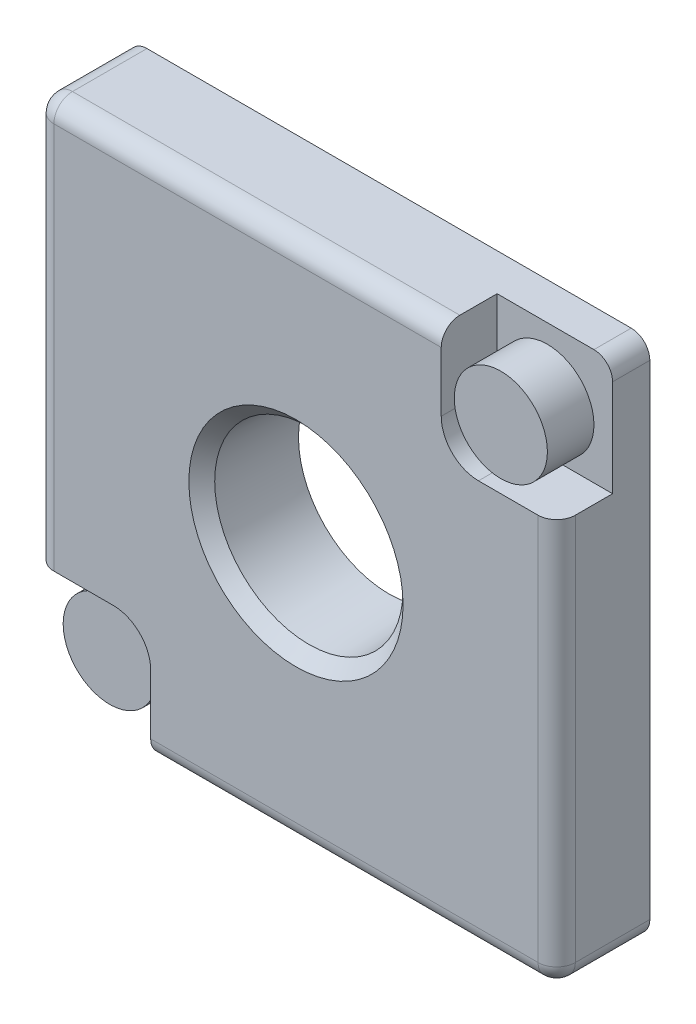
ISO-10303-21;
HEADER;
FILE_DESCRIPTION(('STEP AP214'),'2;1');
FILE_NAME('part.step','',(''),(''),'','','');
FILE_SCHEMA(('AUTOMOTIVE_DESIGN { 1 0 10303 214 1 1 1 1 }'));
ENDSEC;
DATA;
#1=APPLICATION_CONTEXT('core data for automotive mechanical design processes');
#2=APPLICATION_PROTOCOL_DEFINITION('international standard','automotive_design',2000,#1);
#3=PRODUCT_CONTEXT('',#1,'mechanical');
#4=PRODUCT('Part','Part','',(#3));
#5=PRODUCT_RELATED_PRODUCT_CATEGORY('part','',(#4));
#6=PRODUCT_DEFINITION_FORMATION('','',#4);
#7=PRODUCT_DEFINITION_CONTEXT('part definition',#1,'design');
#8=PRODUCT_DEFINITION('design','',#6,#7);
#9=PRODUCT_DEFINITION_SHAPE('','',#8);
#10=(LENGTH_UNIT() NAMED_UNIT(*) SI_UNIT(.MILLI.,.METRE.));
#11=(NAMED_UNIT(*) PLANE_ANGLE_UNIT() SI_UNIT($,.RADIAN.));
#12=(NAMED_UNIT(*) SI_UNIT($,.STERADIAN.) SOLID_ANGLE_UNIT());
#13=UNCERTAINTY_MEASURE_WITH_UNIT(LENGTH_MEASURE(1.E-05),#10,'distance_accuracy_value','');
#14=(GEOMETRIC_REPRESENTATION_CONTEXT(3) GLOBAL_UNCERTAINTY_ASSIGNED_CONTEXT((#13)) GLOBAL_UNIT_ASSIGNED_CONTEXT((#10,
#11,#12)) REPRESENTATION_CONTEXT('',''));
#15=CARTESIAN_POINT('',(0.,0.,0.));
#16=DIRECTION('',(0.,0.,1.));
#17=DIRECTION('',(1.,0.,0.));
#18=AXIS2_PLACEMENT_3D('',#15,#16,#17);
#19=CARTESIAN_POINT('',(14.,-14.,0.));
#20=DIRECTION('',(0.,0.,-1.));
#21=DIRECTION('',(-1.,0.,0.));
#22=AXIS2_PLACEMENT_3D('',#19,#20,#21);
#23=PLANE('',#22);
#24=DIRECTION('',(0.,-1.,0.));
#25=VECTOR('',#24,1.);
#26=CARTESIAN_POINT('',(-13.,-14.,0.));
#27=LINE('',#26,#25);
#28=CARTESIAN_POINT('',(-13.,13.,0.));
#29=VERTEX_POINT('',#28);
#30=CARTESIAN_POINT('',(-13.,-7.80000000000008,0.));
#31=VERTEX_POINT('',#30);
#32=EDGE_CURVE('E231',#29,#31,#27,.T.);
#33=ORIENTED_EDGE('',*,*,#32,.T.);
#34=DIRECTION('',(-1.,0.,0.));
#35=VECTOR('',#34,1.);
#36=CARTESIAN_POINT('',(-13.9999999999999,-7.80000000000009,0.));
#37=LINE('',#36,#35);
#38=CARTESIAN_POINT('',(-9.79999999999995,-7.80000000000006,0.));
#39=VERTEX_POINT('',#38);
#40=EDGE_CURVE('E33',#39,#31,#37,.T.);
#41=ORIENTED_EDGE('',*,*,#40,.F.);
#42=CARTESIAN_POINT('',(-9.79999999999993,-9.80000000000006,0.));
#43=DIRECTION('',(0.,0.,1.));
#44=DIRECTION('',(-1.,0.,0.));
#45=AXIS2_PLACEMENT_3D('',#42,#43,#44);
#46=CIRCLE('',#45,2.);
#47=CARTESIAN_POINT('',(-7.79999999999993,-9.80000000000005,0.));
#48=VERTEX_POINT('',#47);
#49=EDGE_CURVE('E349',#48,#39,#46,.T.);
#50=ORIENTED_EDGE('',*,*,#49,.F.);
#51=DIRECTION('',(0.,1.,0.));
#52=VECTOR('',#51,1.);
#53=CARTESIAN_POINT('',(-7.7999999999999,-14.,0.));
#54=LINE('',#53,#52);
#55=CARTESIAN_POINT('',(-7.79999999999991,-13.,0.));
#56=VERTEX_POINT('',#55);
#57=EDGE_CURVE('E344',#56,#48,#54,.T.);
#58=ORIENTED_EDGE('',*,*,#57,.F.);
#59=DIRECTION('',(1.,0.,0.));
#60=VECTOR('',#59,1.);
#61=CARTESIAN_POINT('',(14.,-13.,0.));
#62=LINE('',#61,#60);
#63=CARTESIAN_POINT('',(13.,-13.,0.));
#64=VERTEX_POINT('',#63);
#65=EDGE_CURVE('E234',#56,#64,#62,.T.);
#66=ORIENTED_EDGE('',*,*,#65,.T.);
#67=DIRECTION('',(0.,1.,0.));
#68=VECTOR('',#67,1.);
#69=CARTESIAN_POINT('',(13.,14.,0.));
#70=LINE('',#69,#68);
#71=CARTESIAN_POINT('',(13.,7.8,0.));
#72=VERTEX_POINT('',#71);
#73=EDGE_CURVE('E236',#64,#72,#70,.T.);
#74=ORIENTED_EDGE('',*,*,#73,.T.);
#75=DIRECTION('',(1.,0.,0.));
#76=VECTOR('',#75,1.);
#77=CARTESIAN_POINT('',(14.,7.8,0.));
#78=LINE('',#77,#76);
#79=CARTESIAN_POINT('',(9.8,7.8,0.));
#80=VERTEX_POINT('',#79);
#81=EDGE_CURVE('E192',#80,#72,#78,.T.);
#82=ORIENTED_EDGE('',*,*,#81,.F.);
#83=CARTESIAN_POINT('',(9.8,9.8,0.));
#84=DIRECTION('',(0.,0.,1.));
#85=DIRECTION('',(1.,0.,0.));
#86=AXIS2_PLACEMENT_3D('',#83,#84,#85);
#87=CIRCLE('',#86,2.);
#88=CARTESIAN_POINT('',(7.8,9.8,0.));
#89=VERTEX_POINT('',#88);
#90=EDGE_CURVE('E204',#89,#80,#87,.T.);
#91=ORIENTED_EDGE('',*,*,#90,.F.);
#92=DIRECTION('',(0.,-1.,0.));
#93=VECTOR('',#92,1.);
#94=CARTESIAN_POINT('',(7.8,14.,0.));
#95=LINE('',#94,#93);
#96=CARTESIAN_POINT('',(7.8,13.,0.));
#97=VERTEX_POINT('',#96);
#98=EDGE_CURVE('E184',#97,#89,#95,.T.);
#99=ORIENTED_EDGE('',*,*,#98,.F.);
#100=DIRECTION('',(-1.,0.,0.));
#101=VECTOR('',#100,1.);
#102=CARTESIAN_POINT('',(-14.,13.,0.));
#103=LINE('',#102,#101);
#104=EDGE_CURVE('E239',#97,#29,#103,.T.);
#105=ORIENTED_EDGE('',*,*,#104,.T.);
#106=EDGE_LOOP('',(#33,#41,#50,#58,#66,#74,#82,#91,#99,#105));
#107=FACE_BOUND('',#106,.T.);
#108=CARTESIAN_POINT('',(0.,0.,0.));
#109=DIRECTION('',(0.,0.,1.));
#110=DIRECTION('',(1.,0.,0.));
#111=AXIS2_PLACEMENT_3D('',#108,#109,#110);
#112=CIRCLE('',#111,5.75);
#113=CARTESIAN_POINT('',(5.75,0.,0.));
#114=VERTEX_POINT('',#113);
#115=EDGE_CURVE('E376',#114,#114,#112,.T.);
#116=ORIENTED_EDGE('',*,*,#115,.F.);
#117=EDGE_LOOP('',(#116));
#118=FACE_BOUND('',#117,.T.);
#119=ADVANCED_FACE('F17',(#107,#118),#23,.F.);
#120=CARTESIAN_POINT('',(-13.,-13.,-5.));
#121=DIRECTION('',(0.,0.,1.));
#122=DIRECTION('',(1.,0.,0.));
#123=AXIS2_PLACEMENT_3D('',#120,#121,#122);
#124=CYLINDRICAL_SURFACE('',#123,1.);
#125=DIRECTION('',(0.,0.,1.));
#126=VECTOR('',#125,1.);
#127=CARTESIAN_POINT('',(-13.,-14.,-5.));
#128=LINE('',#127,#126);
#129=CARTESIAN_POINT('',(-13.,-14.0000000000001,-3.));
#130=VERTEX_POINT('',#129);
#131=CARTESIAN_POINT('',(-13.,-14.,-5.));
#132=VERTEX_POINT('',#131);
#133=EDGE_CURVE('E263',#130,#132,#128,.F.);
#134=ORIENTED_EDGE('',*,*,#133,.F.);
#135=CARTESIAN_POINT('',(-13.,-13.,-3.));
#136=DIRECTION('',(0.,0.,1.));
#137=DIRECTION('',(1.,0.,0.));
#138=AXIS2_PLACEMENT_3D('',#135,#136,#137);
#139=CIRCLE('',#138,1.);
#140=CARTESIAN_POINT('',(-13.9999999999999,-13.,-3.));
#141=VERTEX_POINT('',#140);
#142=EDGE_CURVE('E26',#130,#141,#139,.F.);
#143=ORIENTED_EDGE('',*,*,#142,.T.);
#144=DIRECTION('',(0.,0.,1.));
#145=VECTOR('',#144,1.);
#146=CARTESIAN_POINT('',(-14.,-13.,-5.));
#147=LINE('',#146,#145);
#148=CARTESIAN_POINT('',(-14.,-13.,-5.));
#149=VERTEX_POINT('',#148);
#150=EDGE_CURVE('E272',#149,#141,#147,.T.);
#151=ORIENTED_EDGE('',*,*,#150,.F.);
#152=CARTESIAN_POINT('',(-13.,-13.,-5.));
#153=DIRECTION('',(0.,0.,-1.));
#154=DIRECTION('',(-1.,0.,0.));
#155=AXIS2_PLACEMENT_3D('',#152,#153,#154);
#156=CIRCLE('',#155,1.);
#157=EDGE_CURVE('E257',#132,#149,#156,.T.);
#158=ORIENTED_EDGE('',*,*,#157,.F.);
#159=EDGE_LOOP('',(#134,#143,#151,#158));
#160=FACE_BOUND('',#159,.T.);
#161=ADVANCED_FACE('F302',(#160),#124,.T.);
#162=CARTESIAN_POINT('',(13.,13.,-5.));
#163=DIRECTION('',(0.,0.,1.));
#164=DIRECTION('',(1.,0.,0.));
#165=AXIS2_PLACEMENT_3D('',#162,#163,#164);
#166=CYLINDRICAL_SURFACE('',#165,1.);
#167=DIRECTION('',(0.,0.,1.));
#168=VECTOR('',#167,1.);
#169=CARTESIAN_POINT('',(13.,14.,-5.));
#170=LINE('',#169,#168);
#171=CARTESIAN_POINT('',(13.,14.,-3.));
#172=VERTEX_POINT('',#171);
#173=CARTESIAN_POINT('',(13.,14.,-5.));
#174=VERTEX_POINT('',#173);
#175=EDGE_CURVE('E246',#172,#174,#170,.F.);
#176=ORIENTED_EDGE('',*,*,#175,.F.);
#177=CARTESIAN_POINT('',(13.,13.,-3.));
#178=DIRECTION('',(0.,0.,1.));
#179=DIRECTION('',(1.,0.,0.));
#180=AXIS2_PLACEMENT_3D('',#177,#178,#179);
#181=CIRCLE('',#180,1.);
#182=CARTESIAN_POINT('',(14.,13.,-3.));
#183=VERTEX_POINT('',#182);
#184=EDGE_CURVE('E295',#172,#183,#181,.F.);
#185=ORIENTED_EDGE('',*,*,#184,.T.);
#186=DIRECTION('',(0.,0.,1.));
#187=VECTOR('',#186,1.);
#188=CARTESIAN_POINT('',(14.,13.,-5.));
#189=LINE('',#188,#187);
#190=CARTESIAN_POINT('',(14.,13.,-5.));
#191=VERTEX_POINT('',#190);
#192=EDGE_CURVE('E252',#191,#183,#189,.T.);
#193=ORIENTED_EDGE('',*,*,#192,.F.);
#194=CARTESIAN_POINT('',(13.,13.,-5.));
#195=DIRECTION('',(0.,0.,-1.));
#196=DIRECTION('',(-1.,0.,0.));
#197=AXIS2_PLACEMENT_3D('',#194,#195,#196);
#198=CIRCLE('',#197,1.);
#199=EDGE_CURVE('E261',#174,#191,#198,.T.);
#200=ORIENTED_EDGE('',*,*,#199,.F.);
#201=EDGE_LOOP('',(#176,#185,#193,#200));
#202=FACE_BOUND('',#201,.T.);
#203=ADVANCED_FACE('F329',(#202),#166,.T.);
#204=CARTESIAN_POINT('',(14.,14.,-5.));
#205=DIRECTION('',(1.,0.,0.));
#206=DIRECTION('',(0.,1.,0.));
#207=AXIS2_PLACEMENT_3D('',#204,#205,#206);
#208=PLANE('',#207);
#209=DIRECTION('',(0.,0.,1.));
#210=VECTOR('',#209,1.);
#211=CARTESIAN_POINT('',(14.,7.8,-3.));
#212=LINE('',#211,#210);
#213=CARTESIAN_POINT('',(14.,7.8,-3.));
#214=VERTEX_POINT('',#213);
#215=CARTESIAN_POINT('',(14.,7.8,-1.));
#216=VERTEX_POINT('',#215);
#217=EDGE_CURVE('E208',#214,#216,#212,.T.);
#218=ORIENTED_EDGE('',*,*,#217,.T.);
#219=DIRECTION('',(0.,1.,0.));
#220=VECTOR('',#219,1.);
#221=CARTESIAN_POINT('',(14.,-14.,-1.));
#222=LINE('',#221,#220);
#223=CARTESIAN_POINT('',(14.,-13.,-1.));
#224=VERTEX_POINT('',#223);
#225=EDGE_CURVE('E250',#216,#224,#222,.F.);
#226=ORIENTED_EDGE('',*,*,#225,.T.);
#227=DIRECTION('',(0.,0.,1.));
#228=VECTOR('',#227,1.);
#229=CARTESIAN_POINT('',(14.,-13.,-5.));
#230=LINE('',#229,#228);
#231=CARTESIAN_POINT('',(14.,-13.,-5.));
#232=VERTEX_POINT('',#231);
#233=EDGE_CURVE('E248',#224,#232,#230,.F.);
#234=ORIENTED_EDGE('',*,*,#233,.T.);
#235=DIRECTION('',(0.,1.,0.));
#236=VECTOR('',#235,1.);
#237=CARTESIAN_POINT('',(14.,14.,-5.));
#238=LINE('',#237,#236);
#239=EDGE_CURVE('E218',#232,#191,#238,.T.);
#240=ORIENTED_EDGE('',*,*,#239,.T.);
#241=ORIENTED_EDGE('',*,*,#192,.T.);
#242=DIRECTION('',(0.,1.,0.));
#243=VECTOR('',#242,1.);
#244=CARTESIAN_POINT('',(14.,14.,-3.));
#245=LINE('',#244,#243);
#246=EDGE_CURVE('E189',#214,#183,#245,.T.);
#247=ORIENTED_EDGE('',*,*,#246,.F.);
#248=EDGE_LOOP('',(#218,#226,#234,#240,#241,#247));
#249=FACE_BOUND('',#248,.T.);
#250=ADVANCED_FACE('F332',(#249),#208,.T.);
#251=CARTESIAN_POINT('',(14.,-14.,-5.));
#252=DIRECTION('',(0.,-1.,0.));
#253=DIRECTION('',(1.,0.,0.));
#254=AXIS2_PLACEMENT_3D('',#251,#252,#253);
#255=PLANE('',#254);
#256=DIRECTION('',(0.,0.,1.));
#257=VECTOR('',#256,1.);
#258=CARTESIAN_POINT('',(-7.7999999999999,-14.,-3.));
#259=LINE('',#258,#257);
#260=CARTESIAN_POINT('',(-7.7999999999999,-14.,-3.));
#261=VERTEX_POINT('',#260);
#262=CARTESIAN_POINT('',(-7.7999999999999,-14.,-1.));
#263=VERTEX_POINT('',#262);
#264=EDGE_CURVE('E162',#261,#263,#259,.T.);
#265=ORIENTED_EDGE('',*,*,#264,.F.);
#266=DIRECTION('',(1.,0.,0.));
#267=VECTOR('',#266,1.);
#268=CARTESIAN_POINT('',(-13.9999999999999,-14.0000000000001,-3.));
#269=LINE('',#268,#267);
#270=EDGE_CURVE('E149',#130,#261,#269,.T.);
#271=ORIENTED_EDGE('',*,*,#270,.F.);
#272=ORIENTED_EDGE('',*,*,#133,.T.);
#273=DIRECTION('',(1.,0.,0.));
#274=VECTOR('',#273,1.);
#275=CARTESIAN_POINT('',(14.,-14.,-5.));
#276=LINE('',#275,#274);
#277=CARTESIAN_POINT('',(13.,-14.,-5.));
#278=VERTEX_POINT('',#277);
#279=EDGE_CURVE('E228',#132,#278,#276,.T.);
#280=ORIENTED_EDGE('',*,*,#279,.T.);
#281=DIRECTION('',(0.,0.,1.));
#282=VECTOR('',#281,1.);
#283=CARTESIAN_POINT('',(13.,-14.,-5.));
#284=LINE('',#283,#282);
#285=CARTESIAN_POINT('',(13.,-14.,-1.));
#286=VERTEX_POINT('',#285);
#287=EDGE_CURVE('E266',#278,#286,#284,.T.);
#288=ORIENTED_EDGE('',*,*,#287,.T.);
#289=DIRECTION('',(1.,0.,0.));
#290=VECTOR('',#289,1.);
#291=CARTESIAN_POINT('',(-14.,-14.,-1.));
#292=LINE('',#291,#290);
#293=EDGE_CURVE('E172',#286,#263,#292,.F.);
#294=ORIENTED_EDGE('',*,*,#293,.T.);
#295=EDGE_LOOP('',(#265,#271,#272,#280,#288,#294));
#296=FACE_BOUND('',#295,.T.);
#297=ADVANCED_FACE('F170',(#296),#255,.T.);
#298=CARTESIAN_POINT('',(-14.,14.,-5.));
#299=DIRECTION('',(-1.,0.,0.));
#300=DIRECTION('',(0.,-1.,0.));
#301=AXIS2_PLACEMENT_3D('',#298,#299,#300);
#302=PLANE('',#301);
#303=DIRECTION('',(0.,0.,1.));
#304=VECTOR('',#303,1.);
#305=CARTESIAN_POINT('',(-13.9999999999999,-7.80000000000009,-3.));
#306=LINE('',#305,#304);
#307=CARTESIAN_POINT('',(-13.9999999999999,-7.80000000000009,-3.));
#308=VERTEX_POINT('',#307);
#309=CARTESIAN_POINT('',(-13.9999999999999,-7.80000000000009,-1.));
#310=VERTEX_POINT('',#309);
#311=EDGE_CURVE('E188',#308,#310,#306,.T.);
#312=ORIENTED_EDGE('',*,*,#311,.T.);
#313=DIRECTION('',(0.,-1.,0.));
#314=VECTOR('',#313,1.);
#315=CARTESIAN_POINT('',(-14.,14.,-1.));
#316=LINE('',#315,#314);
#317=CARTESIAN_POINT('',(-14.,13.,-1.));
#318=VERTEX_POINT('',#317);
#319=EDGE_CURVE('E270',#310,#318,#316,.F.);
#320=ORIENTED_EDGE('',*,*,#319,.T.);
#321=DIRECTION('',(0.,0.,1.));
#322=VECTOR('',#321,1.);
#323=CARTESIAN_POINT('',(-14.,13.,-5.));
#324=LINE('',#323,#322);
#325=CARTESIAN_POINT('',(-14.,13.,-5.));
#326=VERTEX_POINT('',#325);
#327=EDGE_CURVE('E268',#318,#326,#324,.F.);
#328=ORIENTED_EDGE('',*,*,#327,.T.);
#329=DIRECTION('',(0.,-1.,0.));
#330=VECTOR('',#329,1.);
#331=CARTESIAN_POINT('',(-14.,14.,-5.));
#332=LINE('',#331,#330);
#333=EDGE_CURVE('E225',#326,#149,#332,.T.);
#334=ORIENTED_EDGE('',*,*,#333,.T.);
#335=ORIENTED_EDGE('',*,*,#150,.T.);
#336=DIRECTION('',(0.,-1.,0.));
#337=VECTOR('',#336,1.);
#338=CARTESIAN_POINT('',(-13.9999999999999,-14.0000000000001,-3.));
#339=LINE('',#338,#337);
#340=EDGE_CURVE('E158',#308,#141,#339,.T.);
#341=ORIENTED_EDGE('',*,*,#340,.F.);
#342=EDGE_LOOP('',(#312,#320,#328,#334,#335,#341));
#343=FACE_BOUND('',#342,.T.);
#344=ADVANCED_FACE('F307',(#343),#302,.T.);
#345=CARTESIAN_POINT('',(14.,14.,-5.));
#346=DIRECTION('',(0.,1.,0.));
#347=DIRECTION('',(-1.,0.,0.));
#348=AXIS2_PLACEMENT_3D('',#345,#346,#347);
#349=PLANE('',#348);
#350=DIRECTION('',(0.,0.,1.));
#351=VECTOR('',#350,1.);
#352=CARTESIAN_POINT('',(7.8,14.,-3.));
#353=LINE('',#352,#351);
#354=CARTESIAN_POINT('',(7.8,14.,-3.));
#355=VERTEX_POINT('',#354);
#356=CARTESIAN_POINT('',(7.8,14.,-1.));
#357=VERTEX_POINT('',#356);
#358=EDGE_CURVE('E41',#355,#357,#353,.T.);
#359=ORIENTED_EDGE('',*,*,#358,.F.);
#360=DIRECTION('',(-1.,0.,0.));
#361=VECTOR('',#360,1.);
#362=CARTESIAN_POINT('',(14.,14.,-3.));
#363=LINE('',#362,#361);
#364=EDGE_CURVE('E191',#172,#355,#363,.T.);
#365=ORIENTED_EDGE('',*,*,#364,.F.);
#366=ORIENTED_EDGE('',*,*,#175,.T.);
#367=DIRECTION('',(-1.,0.,0.));
#368=VECTOR('',#367,1.);
#369=CARTESIAN_POINT('',(14.,14.,-5.));
#370=LINE('',#369,#368);
#371=CARTESIAN_POINT('',(-13.,14.,-5.));
#372=VERTEX_POINT('',#371);
#373=EDGE_CURVE('E221',#174,#372,#370,.T.);
#374=ORIENTED_EDGE('',*,*,#373,.T.);
#375=DIRECTION('',(0.,0.,1.));
#376=VECTOR('',#375,1.);
#377=CARTESIAN_POINT('',(-13.,14.,-5.));
#378=LINE('',#377,#376);
#379=CARTESIAN_POINT('',(-13.,14.,-1.));
#380=VERTEX_POINT('',#379);
#381=EDGE_CURVE('E241',#372,#380,#378,.T.);
#382=ORIENTED_EDGE('',*,*,#381,.T.);
#383=DIRECTION('',(-1.,0.,0.));
#384=VECTOR('',#383,1.);
#385=CARTESIAN_POINT('',(14.,14.,-1.));
#386=LINE('',#385,#384);
#387=EDGE_CURVE('E243',#380,#357,#386,.F.);
#388=ORIENTED_EDGE('',*,*,#387,.T.);
#389=EDGE_LOOP('',(#359,#365,#366,#374,#382,#388));
#390=FACE_BOUND('',#389,.T.);
#391=ADVANCED_FACE('F322',(#390),#349,.T.);
#392=CARTESIAN_POINT('',(14.,-14.,-5.));
#393=DIRECTION('',(0.,0.,-1.));
#394=DIRECTION('',(-1.,0.,0.));
#395=AXIS2_PLACEMENT_3D('',#392,#393,#394);
#396=PLANE('',#395);
#397=CARTESIAN_POINT('',(0.,0.,-5.));
#398=DIRECTION('',(0.,0.,-1.));
#399=DIRECTION('',(-1.,0.,0.));
#400=AXIS2_PLACEMENT_3D('',#397,#398,#399);
#401=CIRCLE('',#400,4.86549211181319);
#402=CARTESIAN_POINT('',(-4.86549211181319,0.,-5.));
#403=VERTEX_POINT('',#402);
#404=EDGE_CURVE('E21',#403,#403,#401,.F.);
#405=ORIENTED_EDGE('',*,*,#404,.T.);
#406=EDGE_LOOP('',(#405));
#407=FACE_BOUND('',#406,.T.);
#408=ORIENTED_EDGE('',*,*,#373,.F.);
#409=ORIENTED_EDGE('',*,*,#199,.T.);
#410=ORIENTED_EDGE('',*,*,#239,.F.);
#411=CARTESIAN_POINT('',(13.,-13.,-5.));
#412=DIRECTION('',(0.,0.,-1.));
#413=DIRECTION('',(-1.,0.,0.));
#414=AXIS2_PLACEMENT_3D('',#411,#412,#413);
#415=CIRCLE('',#414,1.);
#416=EDGE_CURVE('E259',#232,#278,#415,.T.);
#417=ORIENTED_EDGE('',*,*,#416,.T.);
#418=ORIENTED_EDGE('',*,*,#279,.F.);
#419=ORIENTED_EDGE('',*,*,#157,.T.);
#420=ORIENTED_EDGE('',*,*,#333,.F.);
#421=CARTESIAN_POINT('',(-13.,13.,-5.));
#422=DIRECTION('',(0.,0.,-1.));
#423=DIRECTION('',(-1.,0.,0.));
#424=AXIS2_PLACEMENT_3D('',#421,#422,#423);
#425=CIRCLE('',#424,1.);
#426=EDGE_CURVE('E255',#326,#372,#425,.T.);
#427=ORIENTED_EDGE('',*,*,#426,.T.);
#428=EDGE_LOOP('',(#408,#409,#410,#417,#418,#419,#420,#427));
#429=FACE_BOUND('',#428,.T.);
#430=ADVANCED_FACE('F313',(#407,#429),#396,.T.);
#431=CARTESIAN_POINT('',(13.,-13.,-5.));
#432=DIRECTION('',(0.,0.,1.));
#433=DIRECTION('',(1.,0.,0.));
#434=AXIS2_PLACEMENT_3D('',#431,#432,#433);
#435=CYLINDRICAL_SURFACE('',#434,1.);
#436=ORIENTED_EDGE('',*,*,#416,.F.);
#437=ORIENTED_EDGE('',*,*,#233,.F.);
#438=CARTESIAN_POINT('',(13.,-13.,-1.));
#439=DIRECTION('',(0.,0.,1.));
#440=DIRECTION('',(1.,0.,0.));
#441=AXIS2_PLACEMENT_3D('',#438,#439,#440);
#442=CIRCLE('',#441,1.);
#443=EDGE_CURVE('E222',#286,#224,#442,.T.);
#444=ORIENTED_EDGE('',*,*,#443,.F.);
#445=ORIENTED_EDGE('',*,*,#287,.F.);
#446=EDGE_LOOP('',(#436,#437,#444,#445));
#447=FACE_BOUND('',#446,.T.);
#448=ADVANCED_FACE('F19',(#447),#435,.T.);
#449=CARTESIAN_POINT('',(14.,-13.,-1.));
#450=DIRECTION('',(-1.,0.,0.));
#451=DIRECTION('',(0.,-1.,0.));
#452=AXIS2_PLACEMENT_3D('',#449,#450,#451);
#453=CYLINDRICAL_SURFACE('',#452,1.);
#454=CARTESIAN_POINT('',(-7.79999999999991,-13.,-1.));
#455=DIRECTION('',(1.,0.,0.));
#456=DIRECTION('',(0.,1.,0.));
#457=AXIS2_PLACEMENT_3D('',#454,#455,#456);
#458=CIRCLE('',#457,1.);
#459=EDGE_CURVE('E11',#263,#56,#458,.F.);
#460=ORIENTED_EDGE('',*,*,#459,.F.);
#461=ORIENTED_EDGE('',*,*,#293,.F.);
#462=CARTESIAN_POINT('',(13.,-13.,-1.));
#463=DIRECTION('',(1.,0.,0.));
#464=DIRECTION('',(0.,0.,-1.));
#465=AXIS2_PLACEMENT_3D('',#462,#463,#464);
#466=CIRCLE('',#465,1.);
#467=EDGE_CURVE('E287',#64,#286,#466,.T.);
#468=ORIENTED_EDGE('',*,*,#467,.F.);
#469=ORIENTED_EDGE('',*,*,#65,.F.);
#470=EDGE_LOOP('',(#460,#461,#468,#469));
#471=FACE_BOUND('',#470,.T.);
#472=ADVANCED_FACE('F340',(#471),#453,.T.);
#473=CARTESIAN_POINT('',(13.,-13.,-1.));
#474=DIRECTION('',(0.,0.,1.));
#475=DIRECTION('',(1.,0.,0.));
#476=AXIS2_PLACEMENT_3D('',#473,#474,#475);
#477=SPHERICAL_SURFACE('',#476,1.);
#478=ORIENTED_EDGE('',*,*,#467,.T.);
#479=ORIENTED_EDGE('',*,*,#443,.T.);
#480=CARTESIAN_POINT('',(13.,-13.,-1.));
#481=DIRECTION('',(0.,-1.,0.));
#482=DIRECTION('',(0.,0.,-1.));
#483=AXIS2_PLACEMENT_3D('',#480,#481,#482);
#484=CIRCLE('',#483,1.);
#485=EDGE_CURVE('E284',#64,#224,#484,.F.);
#486=ORIENTED_EDGE('',*,*,#485,.F.);
#487=EDGE_LOOP('',(#478,#479,#486));
#488=FACE_BOUND('',#487,.T.);
#489=ADVANCED_FACE('F416',(#488),#477,.T.);
#490=CARTESIAN_POINT('',(13.,-14.,-1.));
#491=DIRECTION('',(0.,-1.,0.));
#492=DIRECTION('',(1.,0.,0.));
#493=AXIS2_PLACEMENT_3D('',#490,#491,#492);
#494=CYLINDRICAL_SURFACE('',#493,1.);
#495=CARTESIAN_POINT('',(13.,7.8,-1.));
#496=DIRECTION('',(0.,-1.,0.));
#497=DIRECTION('',(1.,0.,0.));
#498=AXIS2_PLACEMENT_3D('',#495,#496,#497);
#499=CIRCLE('',#498,1.);
#500=EDGE_CURVE('E293',#72,#216,#499,.F.);
#501=ORIENTED_EDGE('',*,*,#500,.F.);
#502=ORIENTED_EDGE('',*,*,#73,.F.);
#503=ORIENTED_EDGE('',*,*,#485,.T.);
#504=ORIENTED_EDGE('',*,*,#225,.F.);
#505=EDGE_LOOP('',(#501,#502,#503,#504));
#506=FACE_BOUND('',#505,.T.);
#507=ADVANCED_FACE('F413',(#506),#494,.T.);
#508=CARTESIAN_POINT('',(-13.,-14.,-1.));
#509=DIRECTION('',(0.,1.,0.));
#510=DIRECTION('',(-1.,0.,0.));
#511=AXIS2_PLACEMENT_3D('',#508,#509,#510);
#512=CYLINDRICAL_SURFACE('',#511,1.);
#513=CARTESIAN_POINT('',(-13.,-7.80000000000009,-1.));
#514=DIRECTION('',(0.,1.,0.));
#515=DIRECTION('',(-1.,0.,0.));
#516=AXIS2_PLACEMENT_3D('',#513,#514,#515);
#517=CIRCLE('',#516,1.);
#518=EDGE_CURVE('E298',#31,#310,#517,.F.);
#519=ORIENTED_EDGE('',*,*,#518,.F.);
#520=ORIENTED_EDGE('',*,*,#32,.F.);
#521=CARTESIAN_POINT('',(-13.,13.,-1.));
#522=DIRECTION('',(0.,1.,0.));
#523=DIRECTION('',(0.,0.,1.));
#524=AXIS2_PLACEMENT_3D('',#521,#522,#523);
#525=CIRCLE('',#524,1.);
#526=EDGE_CURVE('E281',#318,#29,#525,.T.);
#527=ORIENTED_EDGE('',*,*,#526,.F.);
#528=ORIENTED_EDGE('',*,*,#319,.F.);
#529=EDGE_LOOP('',(#519,#520,#527,#528));
#530=FACE_BOUND('',#529,.T.);
#531=ADVANCED_FACE('F367',(#530),#512,.T.);
#532=CARTESIAN_POINT('',(-13.,13.,-5.));
#533=DIRECTION('',(0.,0.,1.));
#534=DIRECTION('',(1.,0.,0.));
#535=AXIS2_PLACEMENT_3D('',#532,#533,#534);
#536=CYLINDRICAL_SURFACE('',#535,1.);
#537=ORIENTED_EDGE('',*,*,#426,.F.);
#538=ORIENTED_EDGE('',*,*,#327,.F.);
#539=CARTESIAN_POINT('',(-13.,13.,-1.));
#540=DIRECTION('',(0.,0.,1.));
#541=DIRECTION('',(1.,0.,0.));
#542=AXIS2_PLACEMENT_3D('',#539,#540,#541);
#543=CIRCLE('',#542,1.);
#544=EDGE_CURVE('E278',#380,#318,#543,.T.);
#545=ORIENTED_EDGE('',*,*,#544,.F.);
#546=ORIENTED_EDGE('',*,*,#381,.F.);
#547=EDGE_LOOP('',(#537,#538,#545,#546));
#548=FACE_BOUND('',#547,.T.);
#549=ADVANCED_FACE('F317',(#548),#536,.T.);
#550=CARTESIAN_POINT('',(-13.,13.,-1.));
#551=DIRECTION('',(0.,0.,1.));
#552=DIRECTION('',(1.,0.,0.));
#553=AXIS2_PLACEMENT_3D('',#550,#551,#552);
#554=SPHERICAL_SURFACE('',#553,1.);
#555=ORIENTED_EDGE('',*,*,#544,.T.);
#556=ORIENTED_EDGE('',*,*,#526,.T.);
#557=CARTESIAN_POINT('',(-13.,13.,-1.));
#558=DIRECTION('',(-1.,0.,0.));
#559=DIRECTION('',(0.,-1.,0.));
#560=AXIS2_PLACEMENT_3D('',#557,#558,#559);
#561=CIRCLE('',#560,1.);
#562=EDGE_CURVE('E211',#380,#29,#561,.F.);
#563=ORIENTED_EDGE('',*,*,#562,.F.);
#564=EDGE_LOOP('',(#555,#556,#563));
#565=FACE_BOUND('',#564,.T.);
#566=ADVANCED_FACE('F404',(#565),#554,.T.);
#567=CARTESIAN_POINT('',(14.,13.,-1.));
#568=DIRECTION('',(1.,0.,0.));
#569=DIRECTION('',(0.,1.,0.));
#570=AXIS2_PLACEMENT_3D('',#567,#568,#569);
#571=CYLINDRICAL_SURFACE('',#570,1.);
#572=CARTESIAN_POINT('',(7.8,13.,-1.));
#573=DIRECTION('',(-1.,0.,0.));
#574=DIRECTION('',(0.,-1.,0.));
#575=AXIS2_PLACEMENT_3D('',#572,#573,#574);
#576=CIRCLE('',#575,1.);
#577=EDGE_CURVE('E275',#357,#97,#576,.F.);
#578=ORIENTED_EDGE('',*,*,#577,.F.);
#579=ORIENTED_EDGE('',*,*,#387,.F.);
#580=ORIENTED_EDGE('',*,*,#562,.T.);
#581=ORIENTED_EDGE('',*,*,#104,.F.);
#582=EDGE_LOOP('',(#578,#579,#580,#581));
#583=FACE_BOUND('',#582,.T.);
#584=ADVANCED_FACE('F400',(#583),#571,.T.);
#585=CARTESIAN_POINT('',(14.,7.8,-3.));
#586=DIRECTION('',(0.,-1.,0.));
#587=DIRECTION('',(1.,0.,0.));
#588=AXIS2_PLACEMENT_3D('',#585,#586,#587);
#589=PLANE('',#588);
#590=ORIENTED_EDGE('',*,*,#500,.T.);
#591=ORIENTED_EDGE('',*,*,#217,.F.);
#592=DIRECTION('',(1.,0.,0.));
#593=VECTOR('',#592,1.);
#594=CARTESIAN_POINT('',(14.,7.8,-3.));
#595=LINE('',#594,#593);
#596=CARTESIAN_POINT('',(9.8,7.8,-3.));
#597=VERTEX_POINT('',#596);
#598=EDGE_CURVE('E200',#597,#214,#595,.T.);
#599=ORIENTED_EDGE('',*,*,#598,.F.);
#600=DIRECTION('',(0.,0.,1.));
#601=VECTOR('',#600,1.);
#602=CARTESIAN_POINT('',(9.8,7.8,-3.));
#603=LINE('',#602,#601);
#604=EDGE_CURVE('E212',#597,#80,#603,.T.);
#605=ORIENTED_EDGE('',*,*,#604,.T.);
#606=ORIENTED_EDGE('',*,*,#81,.T.);
#607=EDGE_LOOP('',(#590,#591,#599,#605,#606));
#608=FACE_BOUND('',#607,.T.);
#609=ADVANCED_FACE('F403',(#608),#589,.F.);
#610=CARTESIAN_POINT('',(9.8,9.8,-3.));
#611=DIRECTION('',(0.,0.,1.));
#612=DIRECTION('',(1.,0.,0.));
#613=AXIS2_PLACEMENT_3D('',#610,#611,#612);
#614=CYLINDRICAL_SURFACE('',#613,2.);
#615=ORIENTED_EDGE('',*,*,#90,.T.);
#616=ORIENTED_EDGE('',*,*,#604,.F.);
#617=CARTESIAN_POINT('',(9.8,9.8,-3.));
#618=DIRECTION('',(0.,0.,1.));
#619=DIRECTION('',(1.,0.,0.));
#620=AXIS2_PLACEMENT_3D('',#617,#618,#619);
#621=CIRCLE('',#620,2.);
#622=CARTESIAN_POINT('',(7.8,9.8,-3.));
#623=VERTEX_POINT('',#622);
#624=EDGE_CURVE('E197',#623,#597,#621,.T.);
#625=ORIENTED_EDGE('',*,*,#624,.F.);
#626=DIRECTION('',(0.,0.,1.));
#627=VECTOR('',#626,1.);
#628=CARTESIAN_POINT('',(7.8,9.8,-3.));
#629=LINE('',#628,#627);
#630=EDGE_CURVE('E214',#623,#89,#629,.T.);
#631=ORIENTED_EDGE('',*,*,#630,.T.);
#632=EDGE_LOOP('',(#615,#616,#625,#631));
#633=FACE_BOUND('',#632,.T.);
#634=ADVANCED_FACE('F483',(#633),#614,.F.);
#635=CARTESIAN_POINT('',(7.8,14.,-3.));
#636=DIRECTION('',(-1.,0.,0.));
#637=DIRECTION('',(0.,-1.,0.));
#638=AXIS2_PLACEMENT_3D('',#635,#636,#637);
#639=PLANE('',#638);
#640=ORIENTED_EDGE('',*,*,#577,.T.);
#641=ORIENTED_EDGE('',*,*,#98,.T.);
#642=ORIENTED_EDGE('',*,*,#630,.F.);
#643=DIRECTION('',(0.,-1.,0.));
#644=VECTOR('',#643,1.);
#645=CARTESIAN_POINT('',(7.8,14.,-3.));
#646=LINE('',#645,#644);
#647=EDGE_CURVE('E194',#355,#623,#646,.T.);
#648=ORIENTED_EDGE('',*,*,#647,.F.);
#649=ORIENTED_EDGE('',*,*,#358,.T.);
#650=EDGE_LOOP('',(#640,#641,#642,#648,#649));
#651=FACE_BOUND('',#650,.T.);
#652=ADVANCED_FACE('F479',(#651),#639,.F.);
#653=CARTESIAN_POINT('',(9.8,9.8,-3.));
#654=DIRECTION('',(0.,0.,1.));
#655=DIRECTION('',(1.,0.,0.));
#656=AXIS2_PLACEMENT_3D('',#653,#654,#655);
#657=PLANE('',#656);
#658=CARTESIAN_POINT('',(10.5,10.5,-3.));
#659=DIRECTION('',(0.,0.,1.));
#660=DIRECTION('',(1.,0.,0.));
#661=AXIS2_PLACEMENT_3D('',#658,#659,#660);
#662=CIRCLE('',#661,2.5);
#663=CARTESIAN_POINT('',(13.,10.5,-3.));
#664=VERTEX_POINT('',#663);
#665=EDGE_CURVE('E185',#664,#664,#662,.T.);
#666=ORIENTED_EDGE('',*,*,#665,.F.);
#667=EDGE_LOOP('',(#666));
#668=FACE_BOUND('',#667,.T.);
#669=ORIENTED_EDGE('',*,*,#364,.T.);
#670=ORIENTED_EDGE('',*,*,#647,.T.);
#671=ORIENTED_EDGE('',*,*,#624,.T.);
#672=ORIENTED_EDGE('',*,*,#598,.T.);
#673=ORIENTED_EDGE('',*,*,#246,.T.);
#674=ORIENTED_EDGE('',*,*,#184,.F.);
#675=EDGE_LOOP('',(#669,#670,#671,#672,#673,#674));
#676=FACE_BOUND('',#675,.T.);
#677=ADVANCED_FACE('F475',(#668,#676),#657,.T.);
#678=CARTESIAN_POINT('',(10.5,10.5,-0.5));
#679=DIRECTION('',(0.,0.,-1.));
#680=DIRECTION('',(-1.,0.,0.));
#681=AXIS2_PLACEMENT_3D('',#678,#679,#680);
#682=CYLINDRICAL_SURFACE('',#681,2.5);
#683=CARTESIAN_POINT('',(10.5,10.5,-0.5));
#684=DIRECTION('',(0.,0.,1.));
#685=DIRECTION('',(1.,0.,0.));
#686=AXIS2_PLACEMENT_3D('',#683,#684,#685);
#687=CIRCLE('',#686,2.5);
#688=CARTESIAN_POINT('',(13.,10.5,-0.5));
#689=VERTEX_POINT('',#688);
#690=EDGE_CURVE('E181',#689,#689,#687,.T.);
#691=ORIENTED_EDGE('',*,*,#690,.F.);
#692=EDGE_LOOP('',(#691));
#693=FACE_BOUND('',#692,.T.);
#694=ORIENTED_EDGE('',*,*,#665,.T.);
#695=EDGE_LOOP('',(#694));
#696=FACE_BOUND('',#695,.T.);
#697=ADVANCED_FACE('F471',(#693,#696),#682,.T.);
#698=CARTESIAN_POINT('',(10.5,10.5,-0.5));
#699=DIRECTION('',(0.,0.,1.));
#700=DIRECTION('',(1.,0.,0.));
#701=AXIS2_PLACEMENT_3D('',#698,#699,#700);
#702=PLANE('',#701);
#703=ORIENTED_EDGE('',*,*,#690,.T.);
#704=EDGE_LOOP('',(#703));
#705=FACE_BOUND('',#704,.T.);
#706=ADVANCED_FACE('F464',(#705),#702,.T.);
#707=CARTESIAN_POINT('',(-13.9999999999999,-7.80000000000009,-3.));
#708=DIRECTION('',(0.,1.,0.));
#709=DIRECTION('',(-1.,0.,0.));
#710=AXIS2_PLACEMENT_3D('',#707,#708,#709);
#711=PLANE('',#710);
#712=ORIENTED_EDGE('',*,*,#518,.T.);
#713=ORIENTED_EDGE('',*,*,#311,.F.);
#714=DIRECTION('',(-1.,0.,0.));
#715=VECTOR('',#714,1.);
#716=CARTESIAN_POINT('',(-13.9999999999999,-7.80000000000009,-3.));
#717=LINE('',#716,#715);
#718=CARTESIAN_POINT('',(-9.79999999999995,-7.80000000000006,-3.));
#719=VERTEX_POINT('',#718);
#720=EDGE_CURVE('E173',#719,#308,#717,.T.);
#721=ORIENTED_EDGE('',*,*,#720,.F.);
#722=DIRECTION('',(0.,0.,1.));
#723=VECTOR('',#722,1.);
#724=CARTESIAN_POINT('',(-9.79999999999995,-7.80000000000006,-3.));
#725=LINE('',#724,#723);
#726=EDGE_CURVE('E175',#719,#39,#725,.T.);
#727=ORIENTED_EDGE('',*,*,#726,.T.);
#728=ORIENTED_EDGE('',*,*,#40,.T.);
#729=EDGE_LOOP('',(#712,#713,#721,#727,#728));
#730=FACE_BOUND('',#729,.T.);
#731=ADVANCED_FACE('F360',(#730),#711,.F.);
#732=CARTESIAN_POINT('',(-9.79999999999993,-9.80000000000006,-3.));
#733=DIRECTION('',(0.,0.,1.));
#734=DIRECTION('',(1.,0.,0.));
#735=AXIS2_PLACEMENT_3D('',#732,#733,#734);
#736=CYLINDRICAL_SURFACE('',#735,2.);
#737=ORIENTED_EDGE('',*,*,#49,.T.);
#738=ORIENTED_EDGE('',*,*,#726,.F.);
#739=CARTESIAN_POINT('',(-9.79999999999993,-9.80000000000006,-3.));
#740=DIRECTION('',(0.,0.,1.));
#741=DIRECTION('',(-1.,0.,0.));
#742=AXIS2_PLACEMENT_3D('',#739,#740,#741);
#743=CIRCLE('',#742,2.);
#744=CARTESIAN_POINT('',(-7.79999999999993,-9.80000000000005,-3.));
#745=VERTEX_POINT('',#744);
#746=EDGE_CURVE('E167',#745,#719,#743,.T.);
#747=ORIENTED_EDGE('',*,*,#746,.F.);
#748=DIRECTION('',(0.,0.,1.));
#749=VECTOR('',#748,1.);
#750=CARTESIAN_POINT('',(-7.79999999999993,-9.80000000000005,-3.));
#751=LINE('',#750,#749);
#752=EDGE_CURVE('E165',#745,#48,#751,.T.);
#753=ORIENTED_EDGE('',*,*,#752,.T.);
#754=EDGE_LOOP('',(#737,#738,#747,#753));
#755=FACE_BOUND('',#754,.T.);
#756=ADVANCED_FACE('F362',(#755),#736,.F.);
#757=CARTESIAN_POINT('',(-7.7999999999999,-14.,-3.));
#758=DIRECTION('',(1.,0.,0.));
#759=DIRECTION('',(0.,1.,0.));
#760=AXIS2_PLACEMENT_3D('',#757,#758,#759);
#761=PLANE('',#760);
#762=ORIENTED_EDGE('',*,*,#459,.T.);
#763=ORIENTED_EDGE('',*,*,#57,.T.);
#764=ORIENTED_EDGE('',*,*,#752,.F.);
#765=DIRECTION('',(0.,1.,0.));
#766=VECTOR('',#765,1.);
#767=CARTESIAN_POINT('',(-7.7999999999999,-14.,-3.));
#768=LINE('',#767,#766);
#769=EDGE_CURVE('E153',#261,#745,#768,.T.);
#770=ORIENTED_EDGE('',*,*,#769,.F.);
#771=ORIENTED_EDGE('',*,*,#264,.T.);
#772=EDGE_LOOP('',(#762,#763,#764,#770,#771));
#773=FACE_BOUND('',#772,.T.);
#774=ADVANCED_FACE('F161',(#773),#761,.F.);
#775=CARTESIAN_POINT('',(-9.79999999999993,-9.80000000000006,-3.));
#776=DIRECTION('',(0.,0.,1.));
#777=DIRECTION('',(-1.,0.,0.));
#778=AXIS2_PLACEMENT_3D('',#775,#776,#777);
#779=PLANE('',#778);
#780=CARTESIAN_POINT('',(-10.4999999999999,-10.5000000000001,-3.));
#781=DIRECTION('',(0.,0.,1.));
#782=DIRECTION('',(-1.,0.,0.));
#783=AXIS2_PLACEMENT_3D('',#780,#781,#782);
#784=CIRCLE('',#783,2.5);
#785=CARTESIAN_POINT('',(-12.9999999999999,-10.5000000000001,-3.));
#786=VERTEX_POINT('',#785);
#787=EDGE_CURVE('E354',#786,#786,#784,.T.);
#788=ORIENTED_EDGE('',*,*,#787,.F.);
#789=EDGE_LOOP('',(#788));
#790=FACE_BOUND('',#789,.T.);
#791=ORIENTED_EDGE('',*,*,#270,.T.);
#792=ORIENTED_EDGE('',*,*,#769,.T.);
#793=ORIENTED_EDGE('',*,*,#746,.T.);
#794=ORIENTED_EDGE('',*,*,#720,.T.);
#795=ORIENTED_EDGE('',*,*,#340,.T.);
#796=ORIENTED_EDGE('',*,*,#142,.F.);
#797=EDGE_LOOP('',(#791,#792,#793,#794,#795,#796));
#798=FACE_BOUND('',#797,.T.);
#799=ADVANCED_FACE('F151',(#790,#798),#779,.T.);
#800=CARTESIAN_POINT('',(-10.4999999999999,-10.5000000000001,-0.5));
#801=DIRECTION('',(0.,0.,-1.));
#802=DIRECTION('',(-1.,0.,0.));
#803=AXIS2_PLACEMENT_3D('',#800,#801,#802);
#804=CYLINDRICAL_SURFACE('',#803,2.5);
#805=CARTESIAN_POINT('',(-10.4999999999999,-10.5000000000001,-0.5));
#806=DIRECTION('',(0.,0.,1.));
#807=DIRECTION('',(-1.,0.,0.));
#808=AXIS2_PLACEMENT_3D('',#805,#806,#807);
#809=CIRCLE('',#808,2.5);
#810=CARTESIAN_POINT('',(-12.9999999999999,-10.5000000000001,-0.5));
#811=VERTEX_POINT('',#810);
#812=EDGE_CURVE('E350',#811,#811,#809,.T.);
#813=ORIENTED_EDGE('',*,*,#812,.F.);
#814=EDGE_LOOP('',(#813));
#815=FACE_BOUND('',#814,.T.);
#816=ORIENTED_EDGE('',*,*,#787,.T.);
#817=EDGE_LOOP('',(#816));
#818=FACE_BOUND('',#817,.T.);
#819=ADVANCED_FACE('F451',(#815,#818),#804,.T.);
#820=CARTESIAN_POINT('',(-10.4999999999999,-10.5000000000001,-0.5));
#821=DIRECTION('',(0.,0.,1.));
#822=DIRECTION('',(-1.,0.,0.));
#823=AXIS2_PLACEMENT_3D('',#820,#821,#822);
#824=PLANE('',#823);
#825=ORIENTED_EDGE('',*,*,#812,.T.);
#826=EDGE_LOOP('',(#825));
#827=FACE_BOUND('',#826,.T.);
#828=ADVANCED_FACE('F440',(#827),#824,.T.);
#829=CARTESIAN_POINT('',(0.,0.,-6.5));
#830=DIRECTION('',(0.,0.,1.));
#831=DIRECTION('',(1.,0.,0.));
#832=AXIS2_PLACEMENT_3D('',#829,#830,#831);
#833=CONICAL_SURFACE('',#832,4.798991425,0.0443047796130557);
#834=CARTESIAN_POINT('',(0.,0.,-0.693588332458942));
#835=DIRECTION('',(0.,0.,1.));
#836=DIRECTION('',(1.,0.,0.));
#837=AXIS2_PLACEMENT_3D('',#834,#835,#836);
#838=CIRCLE('',#837,5.05641166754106);
#839=CARTESIAN_POINT('',(5.05641166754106,0.,-0.693588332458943));
#840=VERTEX_POINT('',#839);
#841=EDGE_CURVE('E373',#840,#840,#838,.F.);
#842=ORIENTED_EDGE('',*,*,#841,.F.);
#843=EDGE_LOOP('',(#842));
#844=FACE_BOUND('',#843,.T.);
#845=ORIENTED_EDGE('',*,*,#404,.F.);
#846=EDGE_LOOP('',(#845));
#847=FACE_BOUND('',#846,.T.);
#848=ADVANCED_FACE('F438',(#844,#847),#833,.F.);
#849=CARTESIAN_POINT('',(0.,0.,0.));
#850=DIRECTION('',(0.,0.,1.));
#851=DIRECTION('',(1.,0.,0.));
#852=AXIS2_PLACEMENT_3D('',#849,#850,#851);
#853=CONICAL_SURFACE('',#852,5.75,0.78539816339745);
#854=ORIENTED_EDGE('',*,*,#841,.T.);
#855=EDGE_LOOP('',(#854));
#856=FACE_BOUND('',#855,.T.);
#857=ORIENTED_EDGE('',*,*,#115,.T.);
#858=EDGE_LOOP('',(#857));
#859=FACE_BOUND('',#858,.T.);
#860=ADVANCED_FACE('F380',(#856,#859),#853,.F.);
#861=CLOSED_SHELL('',(#119,#161,#203,#250,#297,#344,#391,#430,#448,#472,#489,#507,#531,#549,
#566,#584,#609,#634,#652,#677,#697,#706,#731,#756,#774,#799,#819,#828,#848,#860));
#862=MANIFOLD_SOLID_BREP('B1',#861);
#863=ADVANCED_BREP_SHAPE_REPRESENTATION('',(#18,#862),#14);
#864=SHAPE_DEFINITION_REPRESENTATION(#9,#863);
ENDSEC;
END-ISO-10303-21;
